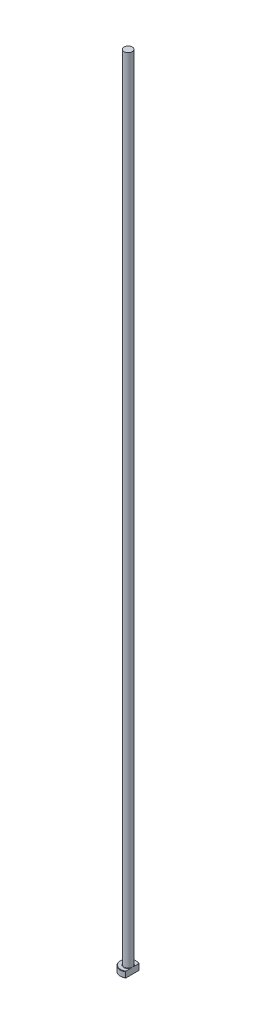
from build123d import *
from build123d.topology import SkipClean

# Parameters (mm, degrees)
CHAMFER1_SIZE = 0.2
FILLET1_R     = 0.2
KEY_DEPTH     = 401.039998


with BuildPart() as part:
    # Sketch1 → Revolve1 (revolve)
    with BuildSketch(Plane.XY, mode=Mode.PRIVATE) as revolve1_sk:
        Polygon((0, 0), (-4, 0), (-4, 3), (-2.05, 3), (-2.05, 400), (0, 400), align=None)
    revolve(revolve1_sk.sketch.rotate(Axis((0, 259.958771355, 0), (0, -1, 0)), 270), axis=Axis((0, 259.958771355, 0), (0, -1, 0)))

    # Chamfer1
    chamfer1_edges = [part.edges().sort_by_distance(p)[0] for p in [
        (0, 3, -4),
        (0, 0, -4),
    ]]
    chamfer(chamfer1_edges, length=CHAMFER1_SIZE)

    # Fillet1
    fillet1_edges = [part.edges().sort_by_distance(p)[0] for p in [
        (0, 3, -2.05),
    ]]
    fillet(fillet1_edges, radius=FILLET1_R)

    # Sketch2 → KEY (cut, through all)
    with SkipClean():  # the faces are left unmerged after this step: merging them gives an invalid solid
        with BuildSketch(Plane(origin=(0, 0, 0), x_dir=(1, 0, 0), z_dir=(0, 1, 0))):
            with BuildLine():
                Line((2.05, 3.434748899), (2.05, -3.434748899))
                ThreePointArc((2.05, -3.434748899), (4, 0), (2.05, 3.434748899))
            make_face()
        extrude(amount=KEY_DEPTH, mode=Mode.SUBTRACT)


solid = part.part
